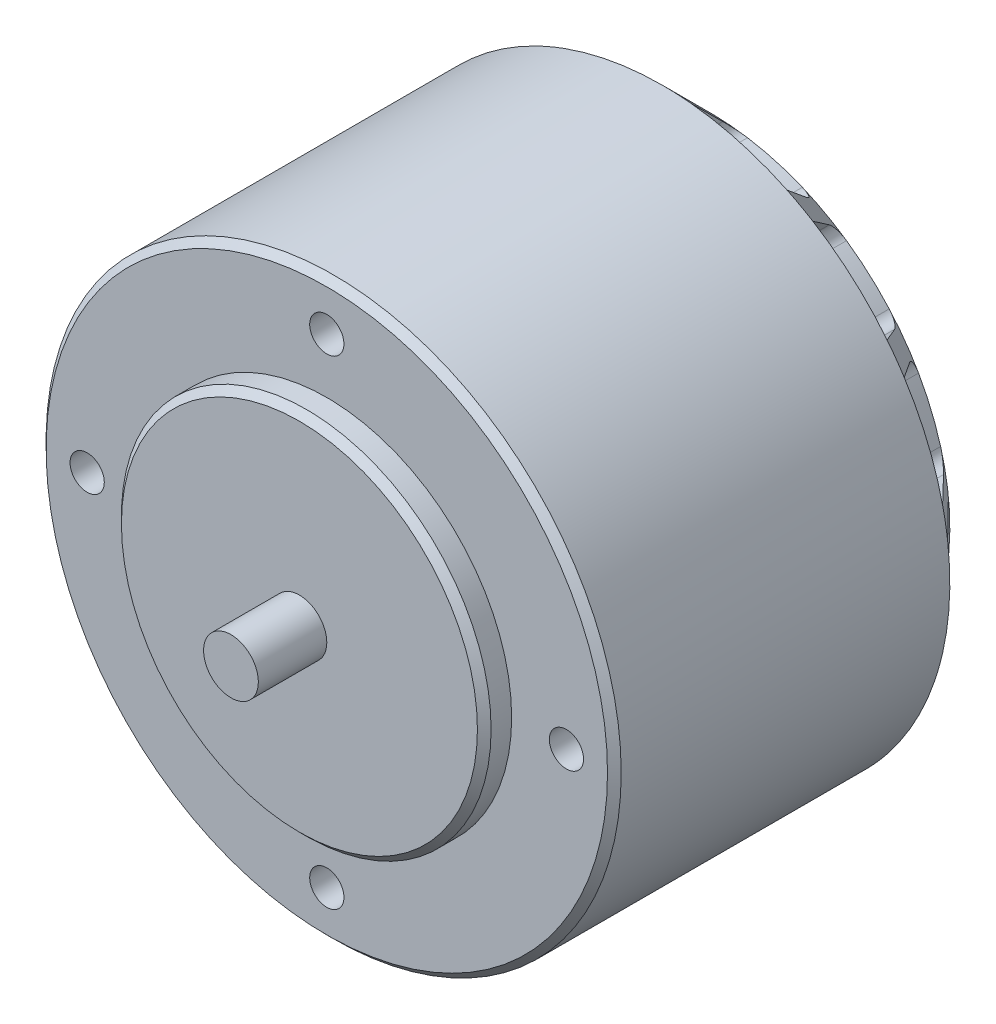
from build123d import *

# Parameters (mm, degrees)
SKETCH1_R             = 21
BOSS_EXTRUDE1_DEPTH   = 30
CHAMFER1_SIZE         = 3.5
CUT_EXTRUDE1_DEPTH    = 3.5
SKETCH3_R             = 3
BOSS_EXTRUDE2_DEPTH   = 4
SKETCH4_R             = 1.25
CUT_EXTRUDE2_DEPTH    = 4
SKETCH5_OUTSIDE_W     = 57.688
SKETCH5_OUTSIDE_H     = 57.688
SKETCH5_OUTSIDE_R     = 13.5
CUT_EXTRUDE3_DEPTH    = 2
CHAMFER2_SIZE         = 0.5
SKETCH6_R             = 1.25
CUT_EXTRUDE4_DEPTH    = 4
SKETCH7_R             = 2
BOSS_EXTRUDE3_DEPTH   = 5
M3_TAPPED_HOLE2_D     = 2.5
M3_TAPPED_HOLE2_DEPTH = 7.5
M3_TAPPED_HOLE2_TIP   = 0.751075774
M3_TAPPED_HOLE3_D     = 2.5
M3_TAPPED_HOLE3_DEPTH = 7.5
M3_TAPPED_HOLE3_TIP   = 0.751075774


with BuildPart() as part:
    # Sketch1 → Boss-Extrude1 (new body)
    with BuildSketch(Plane.XY):
        Circle(SKETCH1_R)
    extrude(amount=BOSS_EXTRUDE1_DEPTH)

    # Chamfer1
    chamfer1_edges = [part.edges().sort_by_distance(p)[0] for p in [
        (-21, 0, 0),
    ]]
    chamfer(chamfer1_edges, length=CHAMFER1_SIZE)

    # Sketch2 → Cut-Extrude1 (cut)
    with BuildSketch(Plane(origin=(0, 0, 0), x_dir=(-1, 0, 0), z_dir=(0, 0, -1))):
        with BuildLine():
            Line((0, 18.472953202), (0, 21))
            ThreePointArc((0, 21), (3.620478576, 20.685553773), (7.132533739, 19.751631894))
            Line((7.132533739, 19.751631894), (6.274236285, 17.374808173))
            ThreePointArc((6.274236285, 17.374808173), (5.782909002, 16.821034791), (5.045375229, 16.756914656))
            ThreePointArc((5.045375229, 16.756914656), (3.01706548, 17.237961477), (0.945945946, 17.474415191))
            ThreePointArc((0.945945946, 17.474415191), (0.274033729, 17.785222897), (0, 18.472953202))
        make_face()
        with BuildLine():
            Line((8.015114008, 16.643555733), (9.111558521, 18.920346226))
            ThreePointArc((9.111558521, 18.920346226), (12.2370639, 17.066173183), (14.996102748, 14.700915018))
            Line((14.996102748, 14.700915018), (13.191538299, 12.93187215))
            ThreePointArc((13.191538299, 12.93187215), (12.508594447, 12.646118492), (11.816278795, 12.908352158))
            ThreePointArc((11.816278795, 12.908352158), (10.19755325, 14.221810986), (8.43413245, 15.333473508))
            ThreePointArc((8.43413245, 15.333473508), (7.96361487, 15.90503336), (8.015114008, 16.643555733))
        make_face()
        with BuildLine():
            Line((14.442736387, 11.517697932), (16.418461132, 13.093285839))
            ThreePointArc((16.418461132, 13.093285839), (18.429948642, 10.066627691), (19.889509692, 6.738501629))
            Line((19.889509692, 6.738501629), (17.496094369, 5.927620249))
            ThreePointArc((17.496094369, 5.927620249), (16.756799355, 5.966483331), (16.246823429, 6.503132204))
            ThreePointArc((16.246823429, 6.503132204), (15.358290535, 8.388856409), (14.251835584, 10.155549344))
            ThreePointArc((14.251835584, 10.155549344), (14.075904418, 10.874656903), (14.442736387, 11.517697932))
        make_face()
        with BuildLine():
            Line((18.009797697, 4.110618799), (20.473486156, 4.672939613))
            ThreePointArc((20.473486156, 4.672939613), (20.972556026, 1.073263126), (20.843555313, -2.558554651))
            Line((20.843555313, -2.558554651), (18.335334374, -2.25066954))
            ThreePointArc((18.335334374, -2.25066954), (17.686114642, -1.894887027), (17.459485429, -1.190112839))
            ThreePointArc((17.459485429, -1.190112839), (17.477130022, 0.894385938), (17.246787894, 2.966194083))
            ThreePointArc((17.246787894, 2.966194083), (17.400288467, 3.690421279), (18.009797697, 4.110618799))
        make_face()
        with BuildLine():
            Line((18.009797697, -4.110618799), (20.473486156, -4.672939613))
            ThreePointArc((20.473486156, -4.672939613), (19.361291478, -8.132674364), (17.669279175, -11.348857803))
            Line((17.669279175, -11.348857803), (15.543036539, -9.983186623))
            ThreePointArc((15.543036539, -9.983186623), (15.112478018, -9.380951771), (15.214082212, -8.647641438))
            ThreePointArc((15.214082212, -8.647641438), (16.134409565, -6.777228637), (16.825802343, -4.810652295))
            ThreePointArc((16.825802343, -4.810652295), (17.278331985, -4.224747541), (18.009797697, -4.110618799))
        make_face()
        with BuildLine():
            Line((14.442736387, -11.517697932), (16.418461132, -13.093285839))
            ThreePointArc((16.418461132, -13.093285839), (13.915285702, -15.727835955), (10.995385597, -17.891380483))
            Line((10.995385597, -17.891380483), (9.672249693, -15.738411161))
            ThreePointArc((9.672249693, -15.738411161), (9.54562978, -15.009003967), (9.955343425, -14.392398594))
            ThreePointArc((9.955343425, -14.392398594), (11.596071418, -13.106529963), (13.072260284, -11.634689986))
            ThreePointArc((13.072260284, -11.634689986), (13.734189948, -11.303153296), (14.442736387, -11.517697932))
        make_face()
        with BuildLine():
            Line((8.015114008, -16.643555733), (9.111558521, -18.920346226))
            ThreePointArc((9.111558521, -18.920346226), (5.713186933, -20.207906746), (2.143721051, -20.890295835))
            Line((2.143721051, -20.890295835), (1.885755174, -18.376450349))
            ThreePointArc((1.885755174, -18.376450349), (2.088152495, -17.664338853), (2.724826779, -17.286564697))
            ThreePointArc((2.724826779, -17.286564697), (4.760989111, -16.839922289), (6.729596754, -16.154334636))
            ThreePointArc((6.729596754, -16.154334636), (7.469823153, -16.142830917), (8.015114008, -16.643555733))
        make_face()
        with BuildLine():
            Line((0, -18.472953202), (0, -21))
            ThreePointArc((0, -21), (-3.620478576, -20.685553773), (-7.132533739, -19.751631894))
            Line((-7.132533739, -19.751631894), (-6.274236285, -17.374808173))
            ThreePointArc((-6.274236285, -17.374808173), (-5.782909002, -16.821034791), (-5.045375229, -16.756914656))
            ThreePointArc((-5.045375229, -16.756914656), (-3.01706548, -17.237961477), (-0.945945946, -17.474415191))
            ThreePointArc((-0.945945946, -17.474415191), (-0.274033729, -17.785222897), (0, -18.472953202))
        make_face()
        with BuildLine():
            Line((-8.015114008, -16.643555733), (-9.111558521, -18.920346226))
            ThreePointArc((-9.111558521, -18.920346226), (-12.2370639, -17.066173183), (-14.996102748, -14.700915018))
            Line((-14.996102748, -14.700915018), (-13.191538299, -12.93187215))
            ThreePointArc((-13.191538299, -12.93187215), (-12.508594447, -12.646118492), (-11.816278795, -12.908352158))
            ThreePointArc((-11.816278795, -12.908352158), (-10.19755325, -14.221810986), (-8.43413245, -15.333473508))
            ThreePointArc((-8.43413245, -15.333473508), (-7.96361487, -15.90503336), (-8.015114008, -16.643555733))
        make_face()
        with BuildLine():
            Line((-14.442736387, -11.517697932), (-16.418461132, -13.093285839))
            ThreePointArc((-16.418461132, -13.093285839), (-18.429948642, -10.066627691), (-19.889509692, -6.738501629))
            Line((-19.889509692, -6.738501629), (-17.496094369, -5.927620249))
            ThreePointArc((-17.496094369, -5.927620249), (-16.756799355, -5.966483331), (-16.246823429, -6.503132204))
            ThreePointArc((-16.246823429, -6.503132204), (-15.358290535, -8.388856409), (-14.251835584, -10.155549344))
            ThreePointArc((-14.251835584, -10.155549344), (-14.075904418, -10.874656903), (-14.442736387, -11.517697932))
        make_face()
        with BuildLine():
            Line((-18.009797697, -4.110618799), (-20.473486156, -4.672939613))
            ThreePointArc((-20.473486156, -4.672939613), (-20.972556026, -1.073263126), (-20.843555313, 2.558554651))
            Line((-20.843555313, 2.558554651), (-18.335334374, 2.25066954))
            ThreePointArc((-18.335334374, 2.25066954), (-17.686114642, 1.894887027), (-17.459485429, 1.190112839))
            ThreePointArc((-17.459485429, 1.190112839), (-17.477130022, -0.894385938), (-17.246787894, -2.966194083))
            ThreePointArc((-17.246787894, -2.966194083), (-17.400288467, -3.690421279), (-18.009797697, -4.110618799))
        make_face()
        with BuildLine():
            Line((-18.009797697, 4.110618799), (-20.473486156, 4.672939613))
            ThreePointArc((-20.473486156, 4.672939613), (-19.361291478, 8.132674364), (-17.669279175, 11.348857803))
            Line((-17.669279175, 11.348857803), (-15.543036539, 9.983186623))
            ThreePointArc((-15.543036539, 9.983186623), (-15.112478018, 9.380951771), (-15.214082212, 8.647641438))
            ThreePointArc((-15.214082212, 8.647641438), (-16.134409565, 6.777228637), (-16.825802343, 4.810652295))
            ThreePointArc((-16.825802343, 4.810652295), (-17.278331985, 4.224747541), (-18.009797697, 4.110618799))
        make_face()
        with BuildLine():
            Line((-14.442736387, 11.517697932), (-16.418461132, 13.093285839))
            ThreePointArc((-16.418461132, 13.093285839), (-13.915285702, 15.727835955), (-10.995385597, 17.891380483))
            Line((-10.995385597, 17.891380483), (-9.672249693, 15.738411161))
            ThreePointArc((-9.672249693, 15.738411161), (-9.54562978, 15.009003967), (-9.955343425, 14.392398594))
            ThreePointArc((-9.955343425, 14.392398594), (-11.596071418, 13.106529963), (-13.072260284, 11.634689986))
            ThreePointArc((-13.072260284, 11.634689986), (-13.734189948, 11.303153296), (-14.442736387, 11.517697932))
        make_face()
        with BuildLine():
            Line((-8.015114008, 16.643555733), (-9.111558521, 18.920346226))
            ThreePointArc((-9.111558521, 18.920346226), (-5.713186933, 20.207906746), (-2.143721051, 20.890295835))
            Line((-2.143721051, 20.890295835), (-1.885755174, 18.376450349))
            ThreePointArc((-1.885755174, 18.376450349), (-2.088152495, 17.664338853), (-2.724826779, 17.286564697))
            ThreePointArc((-2.724826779, 17.286564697), (-4.760989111, 16.839922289), (-6.729596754, 16.154334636))
            ThreePointArc((-6.729596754, 16.154334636), (-7.469823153, 16.142830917), (-8.015114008, 16.643555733))
        make_face()
    extrude(amount=-CUT_EXTRUDE1_DEPTH, mode=Mode.SUBTRACT)

    # Sketch3 → Boss-Extrude2 (add)
    with BuildSketch(Plane(origin=(0, 0, 0), x_dir=(-1, 0, 0), z_dir=(0, 0, -1))):
        with Locations(Location((0, 0, 0), (0, 0, 180))):
            Circle(SKETCH3_R)
    extrude(amount=BOSS_EXTRUDE2_DEPTH)

    # Sketch4 → Cut-Extrude2 (cut)
    with BuildSketch(Plane(origin=(0, 0, 0), x_dir=(-1, 0, 0), z_dir=(0, 0, -1))):
        with Locations((6, 0)):
            Circle(SKETCH4_R)
        with Locations((-6, 0)):
            Circle(SKETCH4_R)
    extrude(amount=-CUT_EXTRUDE2_DEPTH, mode=Mode.SUBTRACT)

    # Sketch5 outside → Cut-Extrude3 (cut)
    with BuildSketch(Plane.XY.offset(30)):
        Rectangle(SKETCH5_OUTSIDE_W, SKETCH5_OUTSIDE_H)
        Circle(SKETCH5_OUTSIDE_R, mode=Mode.SUBTRACT)
    extrude(amount=-CUT_EXTRUDE3_DEPTH, mode=Mode.SUBTRACT)

    # Chamfer2
    chamfer2_edges = [part.edges().sort_by_distance(p)[0] for p in [
        (-21, 0, 28),
        (-13.5, 0, 30),
    ]]
    chamfer(chamfer2_edges, length=CHAMFER2_SIZE)

    # Sketch6 → Cut-Extrude4 (cut)
    with BuildSketch(Plane.XY.offset(28)):
        with Locations((17.5, 0)):
            Circle(SKETCH6_R)
        with Locations((0, -17.5)):
            Circle(SKETCH6_R)
        with Locations((-17.5, 0)):
            Circle(SKETCH6_R)
        with Locations((0, 17.5)):
            Circle(SKETCH6_R)
    extrude(amount=-CUT_EXTRUDE4_DEPTH, mode=Mode.SUBTRACT)

    # Sketch7 → Boss-Extrude3 (add)
    with BuildSketch(Plane.XY.offset(30)):
        Circle(SKETCH7_R)
    extrude(amount=BOSS_EXTRUDE3_DEPTH)

    # M3 Tapped Hole2
    with Locations(Plane(origin=(-17.5, 0, 28), x_dir=(1, 0, 0), z_dir=(0, 0, 1))):
        with Locations((0, 0), (17.5, 17.5), (35, 0), (17.5, -17.5)):
            Hole(M3_TAPPED_HOLE2_D / 2, depth=M3_TAPPED_HOLE2_DEPTH)
            with Locations((0, 0, -(M3_TAPPED_HOLE2_DEPTH + M3_TAPPED_HOLE2_TIP / 2))):  # 118° drill point
                Cone(0, M3_TAPPED_HOLE2_D / 2, M3_TAPPED_HOLE2_TIP, mode=Mode.SUBTRACT)

    # M3 Tapped Hole3
    with Locations(Plane(origin=(-6, 0, 0), x_dir=(-1, 0, 0), z_dir=(0, 0, -1))):
        with Locations((0, 0), (-12, 0)):
            Hole(M3_TAPPED_HOLE3_D / 2, depth=M3_TAPPED_HOLE3_DEPTH)
            with Locations((0, 0, -(M3_TAPPED_HOLE3_DEPTH + M3_TAPPED_HOLE3_TIP / 2))):  # 118° drill point
                Cone(0, M3_TAPPED_HOLE3_D / 2, M3_TAPPED_HOLE3_TIP, mode=Mode.SUBTRACT)


solid = part.part
